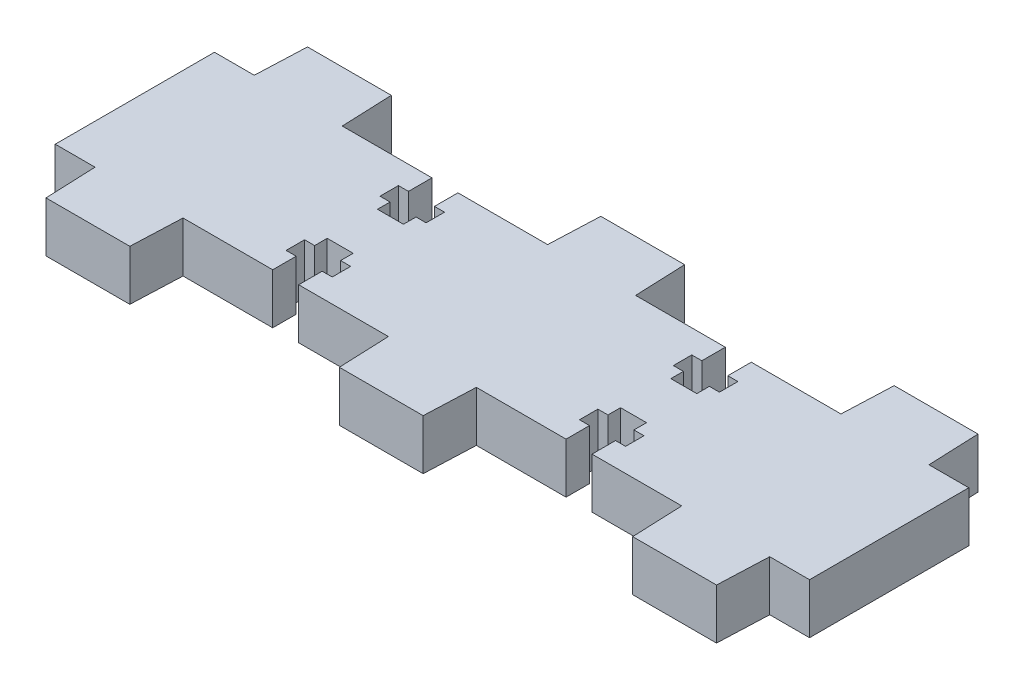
from build123d import *

# Parameters (mm, degrees)
EXTRUDE_1_DEPTH = 6


with BuildPart() as part:
    # Sketch 1 → Extrude 1 (new body)
    with BuildSketch(Plane(origin=(0, 0, 0), x_dir=(1, 0, 0), z_dir=(0, 1, 0))):
        Polygon((0, 15.6), (5, 15.6), (5.25, 9.5), (15.95, 9.5), (15.95, 6.7), (14.75, 6.7), (14.75, 4.5), (15.95, 4.5), (15.95, 3), (19.05, 3), (19.05, 4.5), (20.25, 4.5), (20.25, 6.7), (19.05, 6.7), (19.05, 9.5), (29.75, 9.5), (30, 15.6), (40, 15.6), (40.25, 9.5), (45, 9.5), (45, 0), (0, 0), align=None)
    extrude(amount=EXTRUDE_1_DEPTH)

    # Mirror 1: part across plane


with BuildPart() as part_1:
    add(part.part)
    add(part.part.mirror(Plane(origin=(0, 6, -15.6), x_dir=(0, 0, 1), z_dir=(1, 0, 0))))

    # Mirror 2: part across plane


with BuildPart() as part_2:
    add(part_1.part)
    add(part_1.part.mirror(Plane(origin=(0, 6, 0), x_dir=(1, 0, 0), z_dir=(0, 0, -1))))


solid = part_2.part
